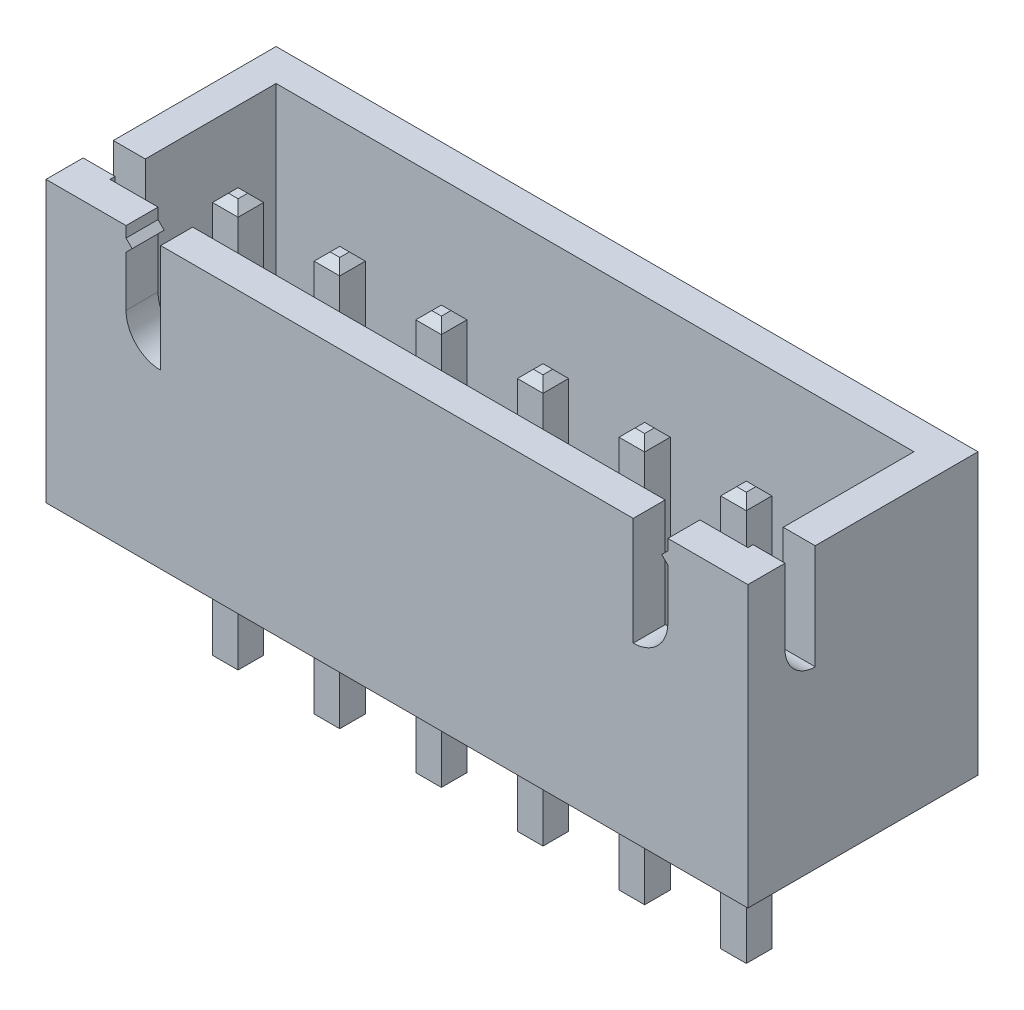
from build123d import *

# Parameters (mm, degrees)
SKETCH1_W                = 17.54
SKETCH1_H                = 5.75
BOSS_EXTRUDE1_DEPTH      = 7
SHELL1_T                 = -0.8
CUT_EXTRUDE1_DEPTH       = 20.102806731
CUT_EXTRUDE2_REACH       = 14.609
BOSS_EXTRUDE2_DEPTH      = 3.45
BOSS_EXTRUDE2_DEPTH_BACK = 6.75
SKETCH4_W                = 0.64
SKETCH4_H                = 0.64
CHAMFER1_SIZE            = 0.2


with BuildPart() as part:
    # Sketch1 → Boss-Extrude1 (new body)
    with BuildSketch(Plane(origin=(0, 0, 0), x_dir=(1, 0, 0), z_dir=(0, 1, 0))):
        Rectangle(SKETCH1_W, SKETCH1_H)
    extrude(amount=BOSS_EXTRUDE1_DEPTH)

    # Shell1
    shell1_openings = [part.faces().sort_by_distance(p)[0] for p in [
        (0, 7, 0),
    ]]
    offset(amount=SHELL1_T, openings=shell1_openings, kind=Kind.INTERSECTION)

    # Sketch2 → Cut-Extrude1 (cut, through all)
    with BuildSketch(Plane(origin=(8.77, 0, 0), x_dir=(0, 0, -1), z_dir=(1, 0, 0))):
        with BuildLine():
            Line((-1.19301282, 7), (-1.19301282, 4.379603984))
            ThreePointArc((-1.19301282, 4.379603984), (-1.72610374, 4.600417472), (-1.946917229, 5.133508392))
            Line((-1.946917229, 5.133508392), (-1.946917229, 7))
            Line((-1.946917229, 7), (-1.19301282, 7))
        make_face()
    extrude(amount=-CUT_EXTRUDE1_DEPTH, mode=Mode.SUBTRACT)

    # Sketch3 → Cut-Extrude2 (cut, up to next)
    with BuildSketch(Plane.XY.offset(2.875), mode=Mode.PRIVATE) as cut_extrude2_sk1:
        with BuildLine():
            Line((-6.77, 7), (-6.77, 6.728922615))
            Line((-6.77, 6.728922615), (-6.617135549, 6.576058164))
            Line((-6.617135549, 6.576058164), (-6.77, 6.423193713))
            Line((-6.77, 6.423193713), (-6.77, 5.166308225))
            ThreePointArc((-6.77, 5.166308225), (-6.516286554, 4.553789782), (-5.90376811, 4.300076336))
            Line((-5.90376811, 4.300076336), (-5.90376811, 7))
            Line((-5.90376811, 7), (-6.77, 7))
        make_face()
    cut_extrude2_tool1 = extrude(cut_extrude2_sk1.sketch, amount=-CUT_EXTRUDE2_REACH, mode=Mode.PRIVATE) & part.part
    # Sketch3 → Cut-Extrude2 (cut, up to next)
    with BuildSketch(Plane.XY.offset(2.875), mode=Mode.PRIVATE) as cut_extrude2_sk2:
        with BuildLine():
            Line((5.90376811, 7), (6.77, 7))
            Line((6.77, 7), (6.77, 6.728922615))
            Line((6.77, 6.728922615), (6.617135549, 6.576058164))
            Line((6.617135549, 6.576058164), (6.77, 6.423193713))
            Line((6.77, 6.423193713), (6.77, 5.166308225))
            ThreePointArc((6.77, 5.166308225), (6.516286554, 4.553789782), (5.90376811, 4.300076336))
            Line((5.90376811, 4.300076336), (5.90376811, 7))
        make_face()
    cut_extrude2_tool2 = extrude(cut_extrude2_sk2.sketch, amount=-CUT_EXTRUDE2_REACH, mode=Mode.PRIVATE) & part.part
    add(cut_extrude2_tool1.solids().sort_by_distance((-6.314828, 5.726435, 2.875))[0], mode=Mode.SUBTRACT)
    add(cut_extrude2_tool2.solids().sort_by_distance((6.314828, 5.726435, 2.875))[0], mode=Mode.SUBTRACT)

    # Sketch4 → Boss-Extrude2 (add, two sides: drawn at the far end of the back side and taken through both)
    with BuildSketch(Plane.XZ.offset(-BOSS_EXTRUDE2_DEPTH_BACK)):
        with Locations((-6.32, 0.525)):
            Rectangle(SKETCH4_W, SKETCH4_H)
        with Locations((-3.78, 0.525)):
            Rectangle(SKETCH4_W, SKETCH4_H)
        with Locations((-1.24, 0.525)):
            Rectangle(SKETCH4_W, SKETCH4_H)
        with Locations((1.3, 0.525)):
            Rectangle(SKETCH4_W, SKETCH4_H)
        with Locations((3.84, 0.525)):
            Rectangle(SKETCH4_W, SKETCH4_H)
        with Locations((6.38, 0.525)):
            Rectangle(SKETCH4_W, SKETCH4_H)
    extrude(amount=BOSS_EXTRUDE2_DEPTH + BOSS_EXTRUDE2_DEPTH_BACK)

    # Chamfer1
    chamfer1_edges = [part.edges().sort_by_distance(p)[0] for p in [
        (-6, 6.75, 0.525),
        (-6.32, 6.75, 0.205),
        (-6.64, 6.75, 0.525),
        (-6.32, 6.75, 0.845),
        (-6, -3.45, 0.525),
        (-6.32, -3.45, 0.845),
        (-6.64, -3.45, 0.525),
        (-6.32, -3.45, 0.205),
        (-3.78, 6.75, 0.205),
        (-4.1, 6.75, 0.525),
        (-3.78, 6.75, 0.845),
        (-3.46, 6.75, 0.525),
        (-3.78, -3.45, 0.205),
        (-3.46, -3.45, 0.525),
        (-3.78, -3.45, 0.845),
        (-4.1, -3.45, 0.525),
        (-1.24, 6.75, 0.205),
        (-1.56, 6.75, 0.525),
        (-1.24, 6.75, 0.845),
        (-0.92, 6.75, 0.525),
        (-1.24, -3.45, 0.205),
        (-0.92, -3.45, 0.525),
        (-1.24, -3.45, 0.845),
        (-1.56, -3.45, 0.525),
        (1.3, 6.75, 0.205),
        (0.98, 6.75, 0.525),
        (1.3, 6.75, 0.845),
        (1.62, 6.75, 0.525),
        (1.3, -3.45, 0.205),
        (1.62, -3.45, 0.525),
        (1.3, -3.45, 0.845),
        (0.98, -3.45, 0.525),
        (3.84, 6.75, 0.205),
        (3.52, 6.75, 0.525),
        (3.84, 6.75, 0.845),
        (4.16, 6.75, 0.525),
        (3.84, -3.45, 0.205),
        (4.16, -3.45, 0.525),
        (3.84, -3.45, 0.845),
        (3.52, -3.45, 0.525),
        (6.38, 6.75, 0.205),
        (6.06, 6.75, 0.525),
        (6.38, 6.75, 0.845),
        (6.7, 6.75, 0.525),
        (6.38, -3.45, 0.205),
        (6.7, -3.45, 0.525),
        (6.38, -3.45, 0.845),
        (6.06, -3.45, 0.525),
    ]]
    chamfer(chamfer1_edges, length=CHAMFER1_SIZE)


solid = part.part
